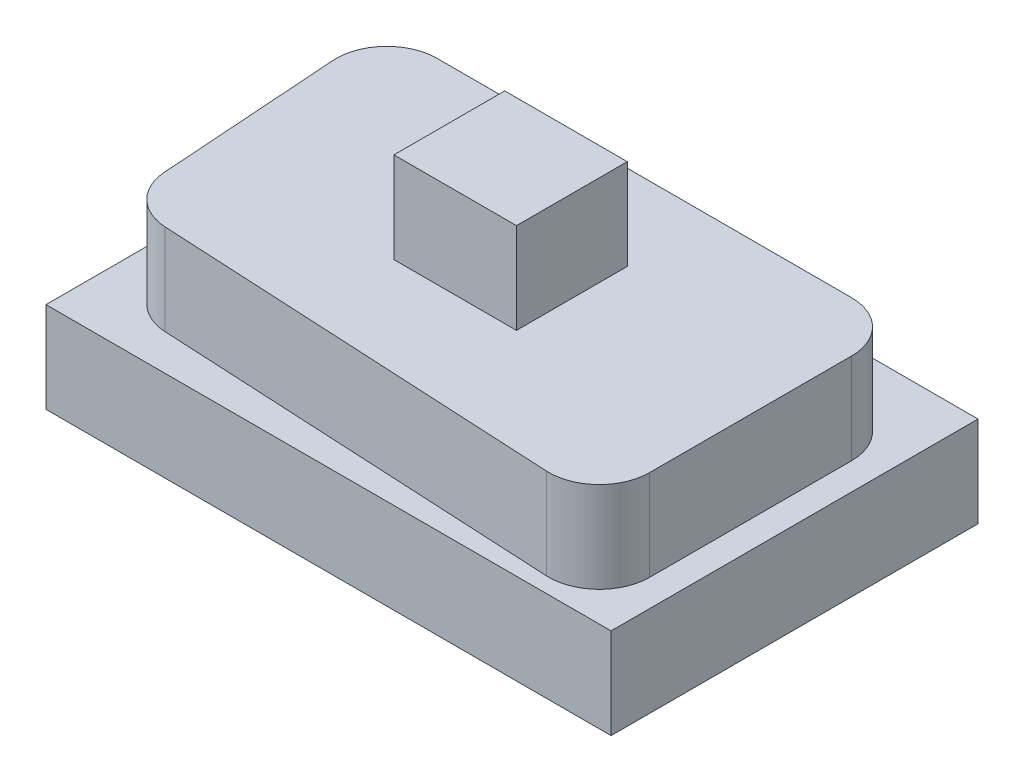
from build123d import *

# Parameters (mm, degrees)
SKETCH1_W           = 56.044614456
SKETCH1_H           = 36.391889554
BOSS_EXTRUDE1_DEPTH = 9
BOSS_EXTRUDE2_DEPTH = 9
SKETCH3_W           = 12.15528397
SKETCH3_H           = 10.98863628
BOSS_EXTRUDE3_DEPTH = 9
FILLET1_R           = 5


with BuildPart() as part:
    # Sketch1 → Boss-Extrude1 (new body)
    with BuildSketch(Plane(origin=(0, 0, 0), x_dir=(1, 0, 0), z_dir=(0, 1, 0))):
        with Locations((28.022307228, 18.195944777)):
            Rectangle(SKETCH1_W, SKETCH1_H)
    extrude(amount=BOSS_EXTRUDE1_DEPTH)

    # Sketch2 → Boss-Extrude2 (add)
    with BuildSketch(Plane(origin=(50.435781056, 9, -36.407083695), x_dir=(1, 0, 0), z_dir=(0, 1, 0))):
        Polygon((2.924312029, -35.156872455), (2.924312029, -4.860935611), (-48.548404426, -4.860935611), (-46.625781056, -32.597083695), align=None)
    extrude(amount=BOSS_EXTRUDE2_DEPTH)

    # Sketch3 → Boss-Extrude3 (add)
    with BuildSketch(Plane(origin=(0, 18, 0), x_dir=(1, 0, 0), z_dir=(0, 1, 0))):
        with Locations((28.468465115, 17.61137227)):
            Rectangle(SKETCH3_W, SKETCH3_H)
    extrude(amount=BOSS_EXTRUDE3_DEPTH)

    # Fillet1
    fillet1_edges = [part.edges().sort_by_distance(p)[0] for p in [
        (3.81, 13.5, -3.81),
        (53.360093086, 13.5, -1.25021124),
        (53.360093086, 13.5, -31.546148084),
        (1.88737663, 13.5, -31.546148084),
    ]]
    fillet(fillet1_edges, radius=FILLET1_R)


solid = part.part
